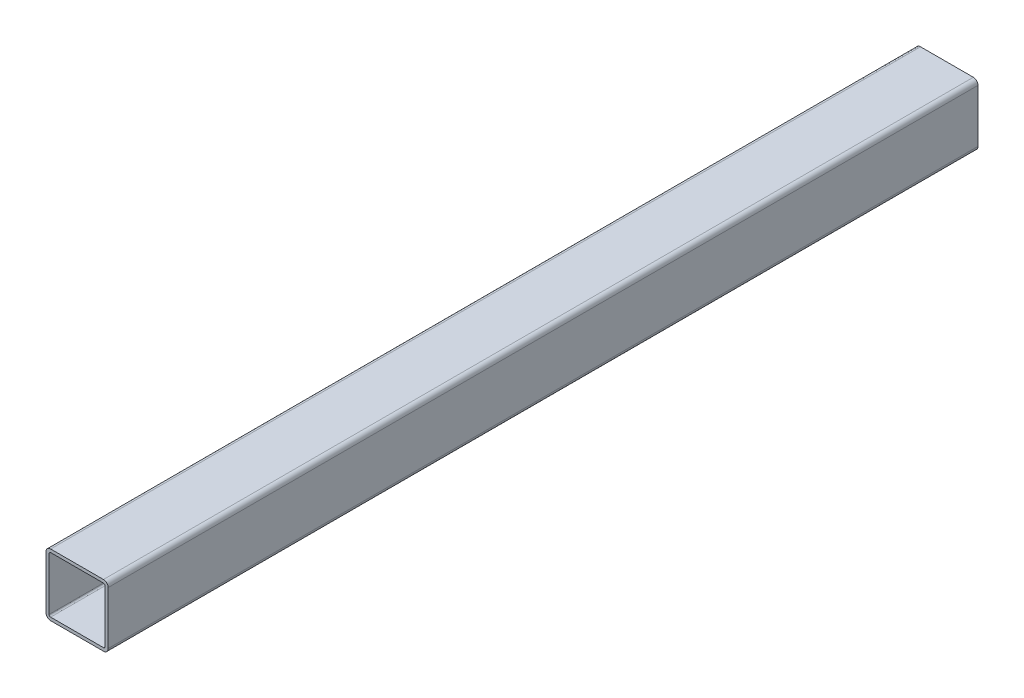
ISO-10303-21;
HEADER;
FILE_DESCRIPTION(('STEP AP214'),'2;1');
FILE_NAME('part.step','',(''),(''),'','','');
FILE_SCHEMA(('AUTOMOTIVE_DESIGN { 1 0 10303 214 1 1 1 1 }'));
ENDSEC;
DATA;
#1=APPLICATION_CONTEXT('core data for automotive mechanical design processes');
#2=APPLICATION_PROTOCOL_DEFINITION('international standard','automotive_design',2000,#1);
#3=PRODUCT_CONTEXT('',#1,'mechanical');
#4=PRODUCT('Part','Part','',(#3));
#5=PRODUCT_RELATED_PRODUCT_CATEGORY('part','',(#4));
#6=PRODUCT_DEFINITION_FORMATION('','',#4);
#7=PRODUCT_DEFINITION_CONTEXT('part definition',#1,'design');
#8=PRODUCT_DEFINITION('design','',#6,#7);
#9=PRODUCT_DEFINITION_SHAPE('','',#8);
#10=(LENGTH_UNIT() NAMED_UNIT(*) SI_UNIT(.MILLI.,.METRE.));
#11=(NAMED_UNIT(*) PLANE_ANGLE_UNIT() SI_UNIT($,.RADIAN.));
#12=(NAMED_UNIT(*) SI_UNIT($,.STERADIAN.) SOLID_ANGLE_UNIT());
#13=UNCERTAINTY_MEASURE_WITH_UNIT(LENGTH_MEASURE(1.E-05),#10,'distance_accuracy_value','');
#14=(GEOMETRIC_REPRESENTATION_CONTEXT(3) GLOBAL_UNCERTAINTY_ASSIGNED_CONTEXT((#13)) GLOBAL_UNIT_ASSIGNED_CONTEXT((#10,
#11,#12)) REPRESENTATION_CONTEXT('',''));
#15=CARTESIAN_POINT('',(0.,0.,0.));
#16=DIRECTION('',(0.,0.,1.));
#17=DIRECTION('',(1.,0.,0.));
#18=AXIS2_PLACEMENT_3D('',#15,#16,#17);
#19=CARTESIAN_POINT('',(3.,37.,560.));
#20=DIRECTION('',(0.,0.,1.));
#21=DIRECTION('',(1.,0.,0.));
#22=AXIS2_PLACEMENT_3D('',#19,#20,#21);
#23=PLANE('',#22);
#24=CARTESIAN_POINT('',(3.,37.,560.));
#25=DIRECTION('',(0.,0.,1.));
#26=DIRECTION('',(1.,0.,0.));
#27=AXIS2_PLACEMENT_3D('',#24,#25,#26);
#28=CIRCLE('',#27,3.);
#29=CARTESIAN_POINT('',(3.00000000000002,40.,560.));
#30=VERTEX_POINT('',#29);
#31=CARTESIAN_POINT('',(0.,37.,560.));
#32=VERTEX_POINT('',#31);
#33=EDGE_CURVE('E219',#30,#32,#28,.T.);
#34=ORIENTED_EDGE('',*,*,#33,.T.);
#35=DIRECTION('',(0.,-1.,0.));
#36=VECTOR('',#35,1.);
#37=CARTESIAN_POINT('',(0.,3.00000000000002,560.));
#38=LINE('',#37,#36);
#39=CARTESIAN_POINT('',(0.,3.00000000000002,560.));
#40=VERTEX_POINT('',#39);
#41=EDGE_CURVE('E222',#32,#40,#38,.T.);
#42=ORIENTED_EDGE('',*,*,#41,.T.);
#43=CARTESIAN_POINT('',(3.,3.,560.));
#44=DIRECTION('',(0.,0.,1.));
#45=DIRECTION('',(1.,0.,0.));
#46=AXIS2_PLACEMENT_3D('',#43,#44,#45);
#47=CIRCLE('',#46,3.);
#48=CARTESIAN_POINT('',(3.00000000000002,0.,560.));
#49=VERTEX_POINT('',#48);
#50=EDGE_CURVE('E224',#40,#49,#47,.T.);
#51=ORIENTED_EDGE('',*,*,#50,.T.);
#52=DIRECTION('',(1.,0.,0.));
#53=VECTOR('',#52,1.);
#54=CARTESIAN_POINT('',(3.00000000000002,0.,560.));
#55=LINE('',#54,#53);
#56=CARTESIAN_POINT('',(37.,0.,560.));
#57=VERTEX_POINT('',#56);
#58=EDGE_CURVE('E226',#49,#57,#55,.T.);
#59=ORIENTED_EDGE('',*,*,#58,.T.);
#60=CARTESIAN_POINT('',(37.,3.,560.));
#61=DIRECTION('',(0.,0.,1.));
#62=DIRECTION('',(1.,0.,0.));
#63=AXIS2_PLACEMENT_3D('',#60,#61,#62);
#64=CIRCLE('',#63,3.);
#65=CARTESIAN_POINT('',(40.,3.00000000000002,560.));
#66=VERTEX_POINT('',#65);
#67=EDGE_CURVE('E228',#57,#66,#64,.T.);
#68=ORIENTED_EDGE('',*,*,#67,.T.);
#69=DIRECTION('',(0.,1.,0.));
#70=VECTOR('',#69,1.);
#71=CARTESIAN_POINT('',(40.,3.00000000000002,560.));
#72=LINE('',#71,#70);
#73=CARTESIAN_POINT('',(40.,37.,560.));
#74=VERTEX_POINT('',#73);
#75=EDGE_CURVE('E230',#66,#74,#72,.T.);
#76=ORIENTED_EDGE('',*,*,#75,.T.);
#77=CARTESIAN_POINT('',(37.,37.,560.));
#78=DIRECTION('',(0.,0.,1.));
#79=DIRECTION('',(1.,0.,0.));
#80=AXIS2_PLACEMENT_3D('',#77,#78,#79);
#81=CIRCLE('',#80,3.);
#82=CARTESIAN_POINT('',(37.,40.,560.));
#83=VERTEX_POINT('',#82);
#84=EDGE_CURVE('E232',#74,#83,#81,.T.);
#85=ORIENTED_EDGE('',*,*,#84,.T.);
#86=DIRECTION('',(-1.,0.,0.));
#87=VECTOR('',#86,1.);
#88=CARTESIAN_POINT('',(3.00000000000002,40.,560.));
#89=LINE('',#88,#87);
#90=EDGE_CURVE('E234',#83,#30,#89,.T.);
#91=ORIENTED_EDGE('',*,*,#90,.T.);
#92=EDGE_LOOP('',(#34,#42,#51,#59,#68,#76,#85,#91));
#93=FACE_BOUND('',#92,.T.);
#94=DIRECTION('',(0.,-1.,0.));
#95=VECTOR('',#94,1.);
#96=CARTESIAN_POINT('',(2.,3.00000000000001,560.));
#97=LINE('',#96,#95);
#98=CARTESIAN_POINT('',(2.,37.,560.));
#99=VERTEX_POINT('',#98);
#100=CARTESIAN_POINT('',(2.,3.00000000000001,560.));
#101=VERTEX_POINT('',#100);
#102=EDGE_CURVE('E177',#99,#101,#97,.T.);
#103=ORIENTED_EDGE('',*,*,#102,.F.);
#104=CARTESIAN_POINT('',(3.,37.,560.));
#105=DIRECTION('',(0.,0.,1.));
#106=DIRECTION('',(1.,0.,0.));
#107=AXIS2_PLACEMENT_3D('',#104,#105,#106);
#108=CIRCLE('',#107,1.);
#109=CARTESIAN_POINT('',(3.00000000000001,38.,560.));
#110=VERTEX_POINT('',#109);
#111=EDGE_CURVE('E154',#110,#99,#108,.T.);
#112=ORIENTED_EDGE('',*,*,#111,.F.);
#113=DIRECTION('',(-1.,0.,0.));
#114=VECTOR('',#113,1.);
#115=CARTESIAN_POINT('',(3.00000000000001,38.,560.));
#116=LINE('',#115,#114);
#117=CARTESIAN_POINT('',(37.,38.,560.));
#118=VERTEX_POINT('',#117);
#119=EDGE_CURVE('E189',#118,#110,#116,.T.);
#120=ORIENTED_EDGE('',*,*,#119,.F.);
#121=CARTESIAN_POINT('',(37.,37.,560.));
#122=DIRECTION('',(0.,0.,1.));
#123=DIRECTION('',(1.,0.,0.));
#124=AXIS2_PLACEMENT_3D('',#121,#122,#123);
#125=CIRCLE('',#124,1.);
#126=CARTESIAN_POINT('',(38.,37.,560.));
#127=VERTEX_POINT('',#126);
#128=EDGE_CURVE('E187',#127,#118,#125,.T.);
#129=ORIENTED_EDGE('',*,*,#128,.F.);
#130=DIRECTION('',(0.,1.,0.));
#131=VECTOR('',#130,1.);
#132=CARTESIAN_POINT('',(38.,3.00000000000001,560.));
#133=LINE('',#132,#131);
#134=CARTESIAN_POINT('',(38.,3.00000000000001,560.));
#135=VERTEX_POINT('',#134);
#136=EDGE_CURVE('E185',#135,#127,#133,.T.);
#137=ORIENTED_EDGE('',*,*,#136,.F.);
#138=CARTESIAN_POINT('',(37.,3.,560.));
#139=DIRECTION('',(0.,0.,1.));
#140=DIRECTION('',(1.,0.,0.));
#141=AXIS2_PLACEMENT_3D('',#138,#139,#140);
#142=CIRCLE('',#141,1.);
#143=CARTESIAN_POINT('',(37.,2.,560.));
#144=VERTEX_POINT('',#143);
#145=EDGE_CURVE('E183',#144,#135,#142,.T.);
#146=ORIENTED_EDGE('',*,*,#145,.F.);
#147=DIRECTION('',(1.,0.,0.));
#148=VECTOR('',#147,1.);
#149=CARTESIAN_POINT('',(3.00000000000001,2.,560.));
#150=LINE('',#149,#148);
#151=CARTESIAN_POINT('',(3.00000000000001,2.,560.));
#152=VERTEX_POINT('',#151);
#153=EDGE_CURVE('E181',#152,#144,#150,.T.);
#154=ORIENTED_EDGE('',*,*,#153,.F.);
#155=CARTESIAN_POINT('',(3.,3.,560.));
#156=DIRECTION('',(0.,0.,1.));
#157=DIRECTION('',(1.,0.,0.));
#158=AXIS2_PLACEMENT_3D('',#155,#156,#157);
#159=CIRCLE('',#158,1.);
#160=EDGE_CURVE('E179',#101,#152,#159,.T.);
#161=ORIENTED_EDGE('',*,*,#160,.F.);
#162=EDGE_LOOP('',(#103,#112,#120,#129,#137,#146,#154,#161));
#163=FACE_BOUND('',#162,.T.);
#164=ADVANCED_FACE('F26',(#93,#163),#23,.T.);
#165=CARTESIAN_POINT('',(3.,37.,0.));
#166=DIRECTION('',(0.,0.,1.));
#167=DIRECTION('',(1.,0.,0.));
#168=AXIS2_PLACEMENT_3D('',#165,#166,#167);
#169=PLANE('',#168);
#170=CARTESIAN_POINT('',(3.,37.,0.));
#171=DIRECTION('',(0.,0.,1.));
#172=DIRECTION('',(1.,0.,0.));
#173=AXIS2_PLACEMENT_3D('',#170,#171,#172);
#174=CIRCLE('',#173,3.);
#175=CARTESIAN_POINT('',(3.00000000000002,40.,0.));
#176=VERTEX_POINT('',#175);
#177=CARTESIAN_POINT('',(0.,37.,0.));
#178=VERTEX_POINT('',#177);
#179=EDGE_CURVE('E155',#176,#178,#174,.T.);
#180=ORIENTED_EDGE('',*,*,#179,.F.);
#181=DIRECTION('',(-1.,0.,0.));
#182=VECTOR('',#181,1.);
#183=CARTESIAN_POINT('',(3.00000000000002,40.,0.));
#184=LINE('',#183,#182);
#185=CARTESIAN_POINT('',(37.,40.,0.));
#186=VERTEX_POINT('',#185);
#187=EDGE_CURVE('E217',#186,#176,#184,.T.);
#188=ORIENTED_EDGE('',*,*,#187,.F.);
#189=CARTESIAN_POINT('',(37.,37.,0.));
#190=DIRECTION('',(0.,0.,1.));
#191=DIRECTION('',(1.,0.,0.));
#192=AXIS2_PLACEMENT_3D('',#189,#190,#191);
#193=CIRCLE('',#192,3.);
#194=CARTESIAN_POINT('',(40.,37.,0.));
#195=VERTEX_POINT('',#194);
#196=EDGE_CURVE('E215',#195,#186,#193,.T.);
#197=ORIENTED_EDGE('',*,*,#196,.F.);
#198=DIRECTION('',(0.,1.,0.));
#199=VECTOR('',#198,1.);
#200=CARTESIAN_POINT('',(40.,3.00000000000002,0.));
#201=LINE('',#200,#199);
#202=CARTESIAN_POINT('',(40.,3.00000000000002,0.));
#203=VERTEX_POINT('',#202);
#204=EDGE_CURVE('E213',#203,#195,#201,.T.);
#205=ORIENTED_EDGE('',*,*,#204,.F.);
#206=CARTESIAN_POINT('',(37.,3.,0.));
#207=DIRECTION('',(0.,0.,1.));
#208=DIRECTION('',(1.,0.,0.));
#209=AXIS2_PLACEMENT_3D('',#206,#207,#208);
#210=CIRCLE('',#209,3.);
#211=CARTESIAN_POINT('',(37.,0.,0.));
#212=VERTEX_POINT('',#211);
#213=EDGE_CURVE('E211',#212,#203,#210,.T.);
#214=ORIENTED_EDGE('',*,*,#213,.F.);
#215=DIRECTION('',(1.,0.,0.));
#216=VECTOR('',#215,1.);
#217=CARTESIAN_POINT('',(3.00000000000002,0.,0.));
#218=LINE('',#217,#216);
#219=CARTESIAN_POINT('',(3.00000000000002,0.,0.));
#220=VERTEX_POINT('',#219);
#221=EDGE_CURVE('E209',#220,#212,#218,.T.);
#222=ORIENTED_EDGE('',*,*,#221,.F.);
#223=CARTESIAN_POINT('',(3.,3.,0.));
#224=DIRECTION('',(0.,0.,1.));
#225=DIRECTION('',(1.,0.,0.));
#226=AXIS2_PLACEMENT_3D('',#223,#224,#225);
#227=CIRCLE('',#226,3.);
#228=CARTESIAN_POINT('',(0.,3.00000000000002,0.));
#229=VERTEX_POINT('',#228);
#230=EDGE_CURVE('E207',#229,#220,#227,.T.);
#231=ORIENTED_EDGE('',*,*,#230,.F.);
#232=DIRECTION('',(0.,-1.,0.));
#233=VECTOR('',#232,1.);
#234=CARTESIAN_POINT('',(0.,3.00000000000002,0.));
#235=LINE('',#234,#233);
#236=EDGE_CURVE('E205',#178,#229,#235,.T.);
#237=ORIENTED_EDGE('',*,*,#236,.F.);
#238=EDGE_LOOP('',(#180,#188,#197,#205,#214,#222,#231,#237));
#239=FACE_BOUND('',#238,.T.);
#240=CARTESIAN_POINT('',(3.,37.,0.));
#241=DIRECTION('',(0.,0.,1.));
#242=DIRECTION('',(1.,0.,0.));
#243=AXIS2_PLACEMENT_3D('',#240,#241,#242);
#244=CIRCLE('',#243,1.);
#245=CARTESIAN_POINT('',(3.00000000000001,38.,0.));
#246=VERTEX_POINT('',#245);
#247=CARTESIAN_POINT('',(2.,37.,0.));
#248=VERTEX_POINT('',#247);
#249=EDGE_CURVE('E49',#246,#248,#244,.T.);
#250=ORIENTED_EDGE('',*,*,#249,.T.);
#251=DIRECTION('',(0.,-1.,0.));
#252=VECTOR('',#251,1.);
#253=CARTESIAN_POINT('',(2.,3.00000000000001,0.));
#254=LINE('',#253,#252);
#255=CARTESIAN_POINT('',(2.,3.00000000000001,0.));
#256=VERTEX_POINT('',#255);
#257=EDGE_CURVE('E141',#248,#256,#254,.T.);
#258=ORIENTED_EDGE('',*,*,#257,.T.);
#259=CARTESIAN_POINT('',(3.,3.,0.));
#260=DIRECTION('',(0.,0.,1.));
#261=DIRECTION('',(1.,0.,0.));
#262=AXIS2_PLACEMENT_3D('',#259,#260,#261);
#263=CIRCLE('',#262,1.);
#264=CARTESIAN_POINT('',(3.00000000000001,2.,0.));
#265=VERTEX_POINT('',#264);
#266=EDGE_CURVE('E150',#256,#265,#263,.T.);
#267=ORIENTED_EDGE('',*,*,#266,.T.);
#268=DIRECTION('',(1.,0.,0.));
#269=VECTOR('',#268,1.);
#270=CARTESIAN_POINT('',(3.00000000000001,2.,0.));
#271=LINE('',#270,#269);
#272=CARTESIAN_POINT('',(37.,2.,0.));
#273=VERTEX_POINT('',#272);
#274=EDGE_CURVE('E164',#265,#273,#271,.T.);
#275=ORIENTED_EDGE('',*,*,#274,.T.);
#276=CARTESIAN_POINT('',(37.,3.,0.));
#277=DIRECTION('',(0.,0.,1.));
#278=DIRECTION('',(1.,0.,0.));
#279=AXIS2_PLACEMENT_3D('',#276,#277,#278);
#280=CIRCLE('',#279,1.);
#281=CARTESIAN_POINT('',(38.,3.00000000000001,0.));
#282=VERTEX_POINT('',#281);
#283=EDGE_CURVE('E167',#273,#282,#280,.T.);
#284=ORIENTED_EDGE('',*,*,#283,.T.);
#285=DIRECTION('',(0.,1.,0.));
#286=VECTOR('',#285,1.);
#287=CARTESIAN_POINT('',(38.,3.00000000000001,0.));
#288=LINE('',#287,#286);
#289=CARTESIAN_POINT('',(38.,37.,0.));
#290=VERTEX_POINT('',#289);
#291=EDGE_CURVE('E170',#282,#290,#288,.T.);
#292=ORIENTED_EDGE('',*,*,#291,.T.);
#293=CARTESIAN_POINT('',(37.,37.,0.));
#294=DIRECTION('',(0.,0.,1.));
#295=DIRECTION('',(1.,0.,0.));
#296=AXIS2_PLACEMENT_3D('',#293,#294,#295);
#297=CIRCLE('',#296,1.);
#298=CARTESIAN_POINT('',(37.,38.,0.));
#299=VERTEX_POINT('',#298);
#300=EDGE_CURVE('E173',#290,#299,#297,.T.);
#301=ORIENTED_EDGE('',*,*,#300,.T.);
#302=DIRECTION('',(-1.,0.,0.));
#303=VECTOR('',#302,1.);
#304=CARTESIAN_POINT('',(3.00000000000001,38.,0.));
#305=LINE('',#304,#303);
#306=EDGE_CURVE('E160',#299,#246,#305,.T.);
#307=ORIENTED_EDGE('',*,*,#306,.T.);
#308=EDGE_LOOP('',(#250,#258,#267,#275,#284,#292,#301,#307));
#309=FACE_BOUND('',#308,.T.);
#310=ADVANCED_FACE('F158',(#239,#309),#169,.F.);
#311=CARTESIAN_POINT('',(3.,37.,560.));
#312=DIRECTION('',(0.,0.,-1.));
#313=DIRECTION('',(-1.,0.,0.));
#314=AXIS2_PLACEMENT_3D('',#311,#312,#313);
#315=CYLINDRICAL_SURFACE('',#314,3.);
#316=ORIENTED_EDGE('',*,*,#179,.T.);
#317=DIRECTION('',(0.,0.,-1.));
#318=VECTOR('',#317,1.);
#319=CARTESIAN_POINT('',(0.,37.,560.));
#320=LINE('',#319,#318);
#321=EDGE_CURVE('E11',#32,#178,#320,.T.);
#322=ORIENTED_EDGE('',*,*,#321,.F.);
#323=ORIENTED_EDGE('',*,*,#33,.F.);
#324=DIRECTION('',(0.,0.,-1.));
#325=VECTOR('',#324,1.);
#326=CARTESIAN_POINT('',(3.00000000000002,40.,560.));
#327=LINE('',#326,#325);
#328=EDGE_CURVE('E236',#30,#176,#327,.T.);
#329=ORIENTED_EDGE('',*,*,#328,.T.);
#330=EDGE_LOOP('',(#316,#322,#323,#329));
#331=FACE_BOUND('',#330,.T.);
#332=ADVANCED_FACE('F28',(#331),#315,.T.);
#333=CARTESIAN_POINT('',(0.,3.00000000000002,560.));
#334=DIRECTION('',(1.,0.,0.));
#335=DIRECTION('',(0.,0.,-1.));
#336=AXIS2_PLACEMENT_3D('',#333,#334,#335);
#337=PLANE('',#336);
#338=ORIENTED_EDGE('',*,*,#236,.T.);
#339=DIRECTION('',(0.,0.,-1.));
#340=VECTOR('',#339,1.);
#341=CARTESIAN_POINT('',(0.,3.00000000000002,560.));
#342=LINE('',#341,#340);
#343=EDGE_CURVE('E34',#40,#229,#342,.T.);
#344=ORIENTED_EDGE('',*,*,#343,.F.);
#345=ORIENTED_EDGE('',*,*,#41,.F.);
#346=ORIENTED_EDGE('',*,*,#321,.T.);
#347=EDGE_LOOP('',(#338,#344,#345,#346));
#348=FACE_BOUND('',#347,.T.);
#349=ADVANCED_FACE('F280',(#348),#337,.F.);
#350=CARTESIAN_POINT('',(3.,3.,560.));
#351=DIRECTION('',(0.,0.,-1.));
#352=DIRECTION('',(-1.,0.,0.));
#353=AXIS2_PLACEMENT_3D('',#350,#351,#352);
#354=CYLINDRICAL_SURFACE('',#353,3.);
#355=ORIENTED_EDGE('',*,*,#230,.T.);
#356=DIRECTION('',(0.,0.,-1.));
#357=VECTOR('',#356,1.);
#358=CARTESIAN_POINT('',(3.00000000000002,0.,560.));
#359=LINE('',#358,#357);
#360=EDGE_CURVE('E251',#49,#220,#359,.T.);
#361=ORIENTED_EDGE('',*,*,#360,.F.);
#362=ORIENTED_EDGE('',*,*,#50,.F.);
#363=ORIENTED_EDGE('',*,*,#343,.T.);
#364=EDGE_LOOP('',(#355,#361,#362,#363));
#365=FACE_BOUND('',#364,.T.);
#366=ADVANCED_FACE('F258',(#365),#354,.T.);
#367=CARTESIAN_POINT('',(3.00000000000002,0.,560.));
#368=DIRECTION('',(0.,1.,0.));
#369=DIRECTION('',(0.,0.,1.));
#370=AXIS2_PLACEMENT_3D('',#367,#368,#369);
#371=PLANE('',#370);
#372=ORIENTED_EDGE('',*,*,#221,.T.);
#373=DIRECTION('',(0.,0.,-1.));
#374=VECTOR('',#373,1.);
#375=CARTESIAN_POINT('',(37.,0.,560.));
#376=LINE('',#375,#374);
#377=EDGE_CURVE('E248',#57,#212,#376,.T.);
#378=ORIENTED_EDGE('',*,*,#377,.F.);
#379=ORIENTED_EDGE('',*,*,#58,.F.);
#380=ORIENTED_EDGE('',*,*,#360,.T.);
#381=EDGE_LOOP('',(#372,#378,#379,#380));
#382=FACE_BOUND('',#381,.T.);
#383=ADVANCED_FACE('F268',(#382),#371,.F.);
#384=CARTESIAN_POINT('',(37.,3.,560.));
#385=DIRECTION('',(0.,0.,-1.));
#386=DIRECTION('',(-1.,0.,0.));
#387=AXIS2_PLACEMENT_3D('',#384,#385,#386);
#388=CYLINDRICAL_SURFACE('',#387,3.);
#389=ORIENTED_EDGE('',*,*,#213,.T.);
#390=DIRECTION('',(0.,0.,-1.));
#391=VECTOR('',#390,1.);
#392=CARTESIAN_POINT('',(40.,3.00000000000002,560.));
#393=LINE('',#392,#391);
#394=EDGE_CURVE('E245',#66,#203,#393,.T.);
#395=ORIENTED_EDGE('',*,*,#394,.F.);
#396=ORIENTED_EDGE('',*,*,#67,.F.);
#397=ORIENTED_EDGE('',*,*,#377,.T.);
#398=EDGE_LOOP('',(#389,#395,#396,#397));
#399=FACE_BOUND('',#398,.T.);
#400=ADVANCED_FACE('F272',(#399),#388,.T.);
#401=CARTESIAN_POINT('',(40.,3.00000000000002,560.));
#402=DIRECTION('',(-1.,0.,0.));
#403=DIRECTION('',(0.,0.,1.));
#404=AXIS2_PLACEMENT_3D('',#401,#402,#403);
#405=PLANE('',#404);
#406=ORIENTED_EDGE('',*,*,#204,.T.);
#407=DIRECTION('',(0.,0.,-1.));
#408=VECTOR('',#407,1.);
#409=CARTESIAN_POINT('',(40.,37.,560.));
#410=LINE('',#409,#408);
#411=EDGE_CURVE('E242',#74,#195,#410,.T.);
#412=ORIENTED_EDGE('',*,*,#411,.F.);
#413=ORIENTED_EDGE('',*,*,#75,.F.);
#414=ORIENTED_EDGE('',*,*,#394,.T.);
#415=EDGE_LOOP('',(#406,#412,#413,#414));
#416=FACE_BOUND('',#415,.T.);
#417=ADVANCED_FACE('F293',(#416),#405,.F.);
#418=CARTESIAN_POINT('',(37.,37.,560.));
#419=DIRECTION('',(0.,0.,-1.));
#420=DIRECTION('',(-1.,0.,0.));
#421=AXIS2_PLACEMENT_3D('',#418,#419,#420);
#422=CYLINDRICAL_SURFACE('',#421,3.);
#423=ORIENTED_EDGE('',*,*,#196,.T.);
#424=DIRECTION('',(0.,0.,-1.));
#425=VECTOR('',#424,1.);
#426=CARTESIAN_POINT('',(37.,40.,560.));
#427=LINE('',#426,#425);
#428=EDGE_CURVE('E239',#83,#186,#427,.T.);
#429=ORIENTED_EDGE('',*,*,#428,.F.);
#430=ORIENTED_EDGE('',*,*,#84,.F.);
#431=ORIENTED_EDGE('',*,*,#411,.T.);
#432=EDGE_LOOP('',(#423,#429,#430,#431));
#433=FACE_BOUND('',#432,.T.);
#434=ADVANCED_FACE('F291',(#433),#422,.T.);
#435=CARTESIAN_POINT('',(3.00000000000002,40.,560.));
#436=DIRECTION('',(0.,-1.,0.));
#437=DIRECTION('',(0.,0.,-1.));
#438=AXIS2_PLACEMENT_3D('',#435,#436,#437);
#439=PLANE('',#438);
#440=ORIENTED_EDGE('',*,*,#187,.T.);
#441=ORIENTED_EDGE('',*,*,#328,.F.);
#442=ORIENTED_EDGE('',*,*,#90,.F.);
#443=ORIENTED_EDGE('',*,*,#428,.T.);
#444=EDGE_LOOP('',(#440,#441,#442,#443));
#445=FACE_BOUND('',#444,.T.);
#446=ADVANCED_FACE('F286',(#445),#439,.F.);
#447=CARTESIAN_POINT('',(3.,37.,560.));
#448=DIRECTION('',(0.,0.,-1.));
#449=DIRECTION('',(-1.,0.,0.));
#450=AXIS2_PLACEMENT_3D('',#447,#448,#449);
#451=CYLINDRICAL_SURFACE('',#450,1.);
#452=ORIENTED_EDGE('',*,*,#249,.F.);
#453=DIRECTION('',(0.,0.,-1.));
#454=VECTOR('',#453,1.);
#455=CARTESIAN_POINT('',(3.00000000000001,38.,560.));
#456=LINE('',#455,#454);
#457=EDGE_CURVE('E191',#110,#246,#456,.T.);
#458=ORIENTED_EDGE('',*,*,#457,.F.);
#459=ORIENTED_EDGE('',*,*,#111,.T.);
#460=DIRECTION('',(0.,0.,-1.));
#461=VECTOR('',#460,1.);
#462=CARTESIAN_POINT('',(2.,37.,560.));
#463=LINE('',#462,#461);
#464=EDGE_CURVE('E143',#99,#248,#463,.T.);
#465=ORIENTED_EDGE('',*,*,#464,.T.);
#466=EDGE_LOOP('',(#452,#458,#459,#465));
#467=FACE_BOUND('',#466,.T.);
#468=ADVANCED_FACE('F152',(#467),#451,.F.);
#469=CARTESIAN_POINT('',(2.,3.00000000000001,560.));
#470=DIRECTION('',(1.,0.,0.));
#471=DIRECTION('',(0.,0.,-1.));
#472=AXIS2_PLACEMENT_3D('',#469,#470,#471);
#473=PLANE('',#472);
#474=ORIENTED_EDGE('',*,*,#257,.F.);
#475=ORIENTED_EDGE('',*,*,#464,.F.);
#476=ORIENTED_EDGE('',*,*,#102,.T.);
#477=DIRECTION('',(0.,0.,-1.));
#478=VECTOR('',#477,1.);
#479=CARTESIAN_POINT('',(2.,3.00000000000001,560.));
#480=LINE('',#479,#478);
#481=EDGE_CURVE('E146',#101,#256,#480,.T.);
#482=ORIENTED_EDGE('',*,*,#481,.T.);
#483=EDGE_LOOP('',(#474,#475,#476,#482));
#484=FACE_BOUND('',#483,.T.);
#485=ADVANCED_FACE('F142',(#484),#473,.T.);
#486=CARTESIAN_POINT('',(3.,3.,560.));
#487=DIRECTION('',(0.,0.,-1.));
#488=DIRECTION('',(-1.,0.,0.));
#489=AXIS2_PLACEMENT_3D('',#486,#487,#488);
#490=CYLINDRICAL_SURFACE('',#489,1.);
#491=ORIENTED_EDGE('',*,*,#266,.F.);
#492=ORIENTED_EDGE('',*,*,#481,.F.);
#493=ORIENTED_EDGE('',*,*,#160,.T.);
#494=DIRECTION('',(0.,0.,-1.));
#495=VECTOR('',#494,1.);
#496=CARTESIAN_POINT('',(3.00000000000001,2.,560.));
#497=LINE('',#496,#495);
#498=EDGE_CURVE('E200',#152,#265,#497,.T.);
#499=ORIENTED_EDGE('',*,*,#498,.T.);
#500=EDGE_LOOP('',(#491,#492,#493,#499));
#501=FACE_BOUND('',#500,.T.);
#502=ADVANCED_FACE('F317',(#501),#490,.F.);
#503=CARTESIAN_POINT('',(3.00000000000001,2.,560.));
#504=DIRECTION('',(0.,1.,0.));
#505=DIRECTION('',(0.,0.,1.));
#506=AXIS2_PLACEMENT_3D('',#503,#504,#505);
#507=PLANE('',#506);
#508=ORIENTED_EDGE('',*,*,#274,.F.);
#509=ORIENTED_EDGE('',*,*,#498,.F.);
#510=ORIENTED_EDGE('',*,*,#153,.T.);
#511=DIRECTION('',(0.,0.,-1.));
#512=VECTOR('',#511,1.);
#513=CARTESIAN_POINT('',(37.,2.,560.));
#514=LINE('',#513,#512);
#515=EDGE_CURVE('E198',#144,#273,#514,.T.);
#516=ORIENTED_EDGE('',*,*,#515,.T.);
#517=EDGE_LOOP('',(#508,#509,#510,#516));
#518=FACE_BOUND('',#517,.T.);
#519=ADVANCED_FACE('F322',(#518),#507,.T.);
#520=CARTESIAN_POINT('',(37.,3.,560.));
#521=DIRECTION('',(0.,0.,-1.));
#522=DIRECTION('',(-1.,0.,0.));
#523=AXIS2_PLACEMENT_3D('',#520,#521,#522);
#524=CYLINDRICAL_SURFACE('',#523,1.);
#525=ORIENTED_EDGE('',*,*,#283,.F.);
#526=ORIENTED_EDGE('',*,*,#515,.F.);
#527=ORIENTED_EDGE('',*,*,#145,.T.);
#528=DIRECTION('',(0.,0.,-1.));
#529=VECTOR('',#528,1.);
#530=CARTESIAN_POINT('',(38.,3.00000000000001,560.));
#531=LINE('',#530,#529);
#532=EDGE_CURVE('E196',#135,#282,#531,.T.);
#533=ORIENTED_EDGE('',*,*,#532,.T.);
#534=EDGE_LOOP('',(#525,#526,#527,#533));
#535=FACE_BOUND('',#534,.T.);
#536=ADVANCED_FACE('F326',(#535),#524,.F.);
#537=CARTESIAN_POINT('',(38.,3.00000000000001,560.));
#538=DIRECTION('',(-1.,0.,0.));
#539=DIRECTION('',(0.,0.,1.));
#540=AXIS2_PLACEMENT_3D('',#537,#538,#539);
#541=PLANE('',#540);
#542=ORIENTED_EDGE('',*,*,#291,.F.);
#543=ORIENTED_EDGE('',*,*,#532,.F.);
#544=ORIENTED_EDGE('',*,*,#136,.T.);
#545=DIRECTION('',(0.,0.,-1.));
#546=VECTOR('',#545,1.);
#547=CARTESIAN_POINT('',(38.,37.,560.));
#548=LINE('',#547,#546);
#549=EDGE_CURVE('E194',#127,#290,#548,.T.);
#550=ORIENTED_EDGE('',*,*,#549,.T.);
#551=EDGE_LOOP('',(#542,#543,#544,#550));
#552=FACE_BOUND('',#551,.T.);
#553=ADVANCED_FACE('F330',(#552),#541,.T.);
#554=CARTESIAN_POINT('',(37.,37.,560.));
#555=DIRECTION('',(0.,0.,-1.));
#556=DIRECTION('',(-1.,0.,0.));
#557=AXIS2_PLACEMENT_3D('',#554,#555,#556);
#558=CYLINDRICAL_SURFACE('',#557,1.);
#559=ORIENTED_EDGE('',*,*,#300,.F.);
#560=ORIENTED_EDGE('',*,*,#549,.F.);
#561=ORIENTED_EDGE('',*,*,#128,.T.);
#562=DIRECTION('',(0.,0.,-1.));
#563=VECTOR('',#562,1.);
#564=CARTESIAN_POINT('',(37.,38.,560.));
#565=LINE('',#564,#563);
#566=EDGE_CURVE('E41',#118,#299,#565,.T.);
#567=ORIENTED_EDGE('',*,*,#566,.T.);
#568=EDGE_LOOP('',(#559,#560,#561,#567));
#569=FACE_BOUND('',#568,.T.);
#570=ADVANCED_FACE('F334',(#569),#558,.F.);
#571=CARTESIAN_POINT('',(3.00000000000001,38.,560.));
#572=DIRECTION('',(0.,-1.,0.));
#573=DIRECTION('',(0.,0.,-1.));
#574=AXIS2_PLACEMENT_3D('',#571,#572,#573);
#575=PLANE('',#574);
#576=ORIENTED_EDGE('',*,*,#306,.F.);
#577=ORIENTED_EDGE('',*,*,#566,.F.);
#578=ORIENTED_EDGE('',*,*,#119,.T.);
#579=ORIENTED_EDGE('',*,*,#457,.T.);
#580=EDGE_LOOP('',(#576,#577,#578,#579));
#581=FACE_BOUND('',#580,.T.);
#582=ADVANCED_FACE('F338',(#581),#575,.T.);
#583=CLOSED_SHELL('',(#164,#310,#332,#349,#366,#383,#400,#417,#434,#446,#468,#485,#502,#519,
#536,#553,#570,#582));
#584=MANIFOLD_SOLID_BREP('B2',#583);
#585=ADVANCED_BREP_SHAPE_REPRESENTATION('',(#18,#584),#14);
#586=SHAPE_DEFINITION_REPRESENTATION(#9,#585);
ENDSEC;
END-ISO-10303-21;
